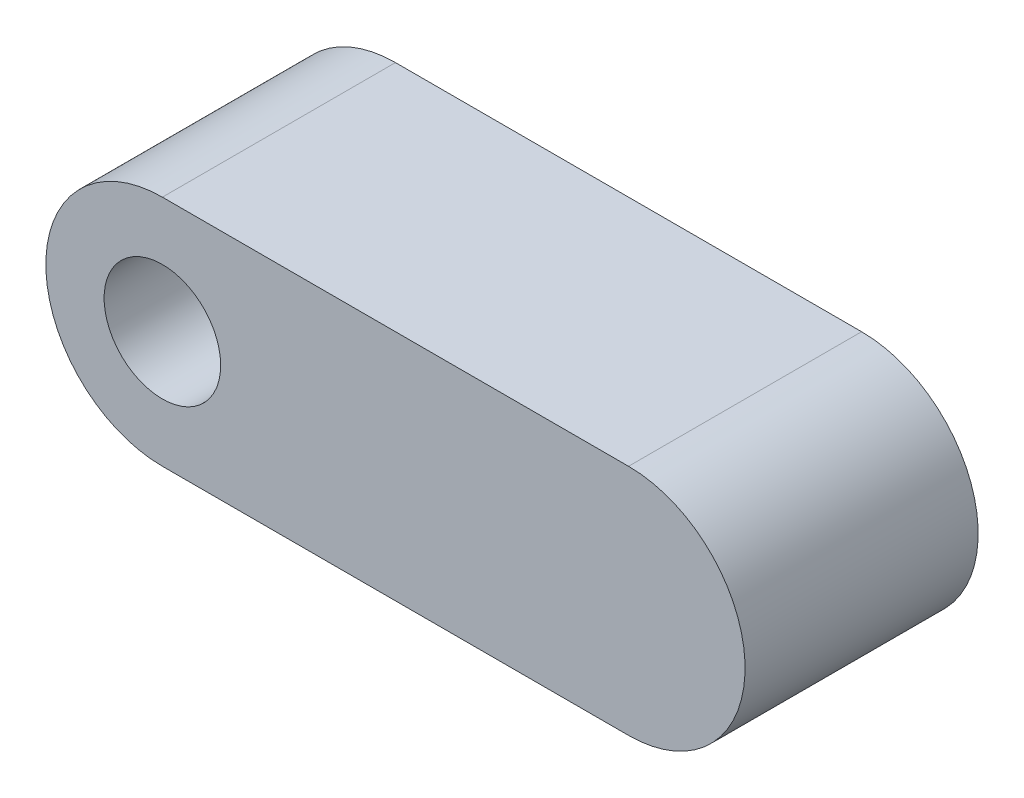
ISO-10303-21;
HEADER;
FILE_DESCRIPTION(('STEP AP214'),'2;1');
FILE_NAME('part.step','',(''),(''),'','','');
FILE_SCHEMA(('AUTOMOTIVE_DESIGN { 1 0 10303 214 1 1 1 1 }'));
ENDSEC;
DATA;
#1=APPLICATION_CONTEXT('core data for automotive mechanical design processes');
#2=APPLICATION_PROTOCOL_DEFINITION('international standard','automotive_design',2000,#1);
#3=PRODUCT_CONTEXT('',#1,'mechanical');
#4=PRODUCT('Part','Part','',(#3));
#5=PRODUCT_RELATED_PRODUCT_CATEGORY('part','',(#4));
#6=PRODUCT_DEFINITION_FORMATION('','',#4);
#7=PRODUCT_DEFINITION_CONTEXT('part definition',#1,'design');
#8=PRODUCT_DEFINITION('design','',#6,#7);
#9=PRODUCT_DEFINITION_SHAPE('','',#8);
#10=(LENGTH_UNIT() NAMED_UNIT(*) SI_UNIT(.MILLI.,.METRE.));
#11=(NAMED_UNIT(*) PLANE_ANGLE_UNIT() SI_UNIT($,.RADIAN.));
#12=(NAMED_UNIT(*) SI_UNIT($,.STERADIAN.) SOLID_ANGLE_UNIT());
#13=UNCERTAINTY_MEASURE_WITH_UNIT(LENGTH_MEASURE(1.E-05),#10,'distance_accuracy_value','');
#14=(GEOMETRIC_REPRESENTATION_CONTEXT(3) GLOBAL_UNCERTAINTY_ASSIGNED_CONTEXT((#13)) GLOBAL_UNIT_ASSIGNED_CONTEXT((#10,
#11,#12)) REPRESENTATION_CONTEXT('',''));
#15=CARTESIAN_POINT('',(0.,0.,0.));
#16=DIRECTION('',(0.,0.,1.));
#17=DIRECTION('',(1.,0.,0.));
#18=AXIS2_PLACEMENT_3D('',#15,#16,#17);
#19=CARTESIAN_POINT('',(0.,0.,0.999999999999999));
#20=DIRECTION('',(0.,0.,1.));
#21=DIRECTION('',(1.,0.,0.));
#22=AXIS2_PLACEMENT_3D('',#19,#20,#21);
#23=PLANE('',#22);
#24=CARTESIAN_POINT('',(0.,0.,0.999999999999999));
#25=DIRECTION('',(0.,0.,1.));
#26=DIRECTION('',(1.,0.,0.));
#27=AXIS2_PLACEMENT_3D('',#24,#25,#26);
#28=CIRCLE('',#27,1.);
#29=CARTESIAN_POINT('',(0.,1.,0.999999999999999));
#30=VERTEX_POINT('',#29);
#31=CARTESIAN_POINT('',(0.,-0.999999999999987,0.999999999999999));
#32=VERTEX_POINT('',#31);
#33=EDGE_CURVE('E104',#30,#32,#28,.T.);
#34=ORIENTED_EDGE('',*,*,#33,.T.);
#35=DIRECTION('',(1.,0.,0.));
#36=VECTOR('',#35,1.);
#37=CARTESIAN_POINT('',(0.,-0.999999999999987,0.999999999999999));
#38=LINE('',#37,#36);
#39=CARTESIAN_POINT('',(4.,-0.999999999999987,1.));
#40=VERTEX_POINT('',#39);
#41=EDGE_CURVE('E89',#32,#40,#38,.T.);
#42=ORIENTED_EDGE('',*,*,#41,.T.);
#43=CARTESIAN_POINT('',(4.,0.,1.));
#44=DIRECTION('',(0.,0.,1.));
#45=DIRECTION('',(-1.,0.,0.));
#46=AXIS2_PLACEMENT_3D('',#43,#44,#45);
#47=CIRCLE('',#46,1.);
#48=CARTESIAN_POINT('',(3.99999999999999,1.,1.));
#49=VERTEX_POINT('',#48);
#50=EDGE_CURVE('E55',#40,#49,#47,.T.);
#51=ORIENTED_EDGE('',*,*,#50,.T.);
#52=DIRECTION('',(-1.,0.,0.));
#53=VECTOR('',#52,1.);
#54=CARTESIAN_POINT('',(0.,1.,0.999999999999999));
#55=LINE('',#54,#53);
#56=EDGE_CURVE('E50',#49,#30,#55,.T.);
#57=ORIENTED_EDGE('',*,*,#56,.T.);
#58=EDGE_LOOP('',(#34,#42,#51,#57));
#59=FACE_BOUND('',#58,.T.);
#60=CARTESIAN_POINT('',(0.,0.,0.999999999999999));
#61=DIRECTION('',(0.,0.,1.));
#62=DIRECTION('',(1.,0.,0.));
#63=AXIS2_PLACEMENT_3D('',#60,#61,#62);
#64=CIRCLE('',#63,0.5);
#65=CARTESIAN_POINT('',(0.5,0.,0.999999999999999));
#66=VERTEX_POINT('',#65);
#67=EDGE_CURVE('E94',#66,#66,#64,.T.);
#68=ORIENTED_EDGE('',*,*,#67,.F.);
#69=EDGE_LOOP('',(#68));
#70=FACE_BOUND('',#69,.T.);
#71=ADVANCED_FACE('F35',(#59,#70),#23,.T.);
#72=CARTESIAN_POINT('',(0.,0.,-1.));
#73=DIRECTION('',(0.,0.,1.));
#74=DIRECTION('',(1.,0.,0.));
#75=AXIS2_PLACEMENT_3D('',#72,#73,#74);
#76=PLANE('',#75);
#77=CARTESIAN_POINT('',(0.,0.,-1.));
#78=DIRECTION('',(0.,0.,1.));
#79=DIRECTION('',(1.,0.,0.));
#80=AXIS2_PLACEMENT_3D('',#77,#78,#79);
#81=CIRCLE('',#80,1.);
#82=CARTESIAN_POINT('',(0.,1.,-1.));
#83=VERTEX_POINT('',#82);
#84=CARTESIAN_POINT('',(0.,-0.999999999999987,-1.));
#85=VERTEX_POINT('',#84);
#86=EDGE_CURVE('E81',#83,#85,#81,.T.);
#87=ORIENTED_EDGE('',*,*,#86,.F.);
#88=DIRECTION('',(-1.,0.,0.));
#89=VECTOR('',#88,1.);
#90=CARTESIAN_POINT('',(0.,1.,-1.));
#91=LINE('',#90,#89);
#92=CARTESIAN_POINT('',(3.99999999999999,1.,-1.));
#93=VERTEX_POINT('',#92);
#94=EDGE_CURVE('E102',#93,#83,#91,.T.);
#95=ORIENTED_EDGE('',*,*,#94,.F.);
#96=CARTESIAN_POINT('',(4.,0.,-1.));
#97=DIRECTION('',(0.,0.,1.));
#98=DIRECTION('',(-1.,0.,0.));
#99=AXIS2_PLACEMENT_3D('',#96,#97,#98);
#100=CIRCLE('',#99,1.);
#101=CARTESIAN_POINT('',(4.,-0.999999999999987,-1.));
#102=VERTEX_POINT('',#101);
#103=EDGE_CURVE('E82',#102,#93,#100,.T.);
#104=ORIENTED_EDGE('',*,*,#103,.F.);
#105=DIRECTION('',(1.,0.,0.));
#106=VECTOR('',#105,1.);
#107=CARTESIAN_POINT('',(0.,-0.999999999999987,-1.));
#108=LINE('',#107,#106);
#109=EDGE_CURVE('E76',#85,#102,#108,.T.);
#110=ORIENTED_EDGE('',*,*,#109,.F.);
#111=EDGE_LOOP('',(#87,#95,#104,#110));
#112=FACE_BOUND('',#111,.T.);
#113=CARTESIAN_POINT('',(0.,0.,-1.));
#114=DIRECTION('',(0.,0.,1.));
#115=DIRECTION('',(1.,0.,0.));
#116=AXIS2_PLACEMENT_3D('',#113,#114,#115);
#117=CIRCLE('',#116,0.5);
#118=CARTESIAN_POINT('',(0.5,0.,-1.));
#119=VERTEX_POINT('',#118);
#120=EDGE_CURVE('E97',#119,#119,#117,.T.);
#121=ORIENTED_EDGE('',*,*,#120,.T.);
#122=EDGE_LOOP('',(#121));
#123=FACE_BOUND('',#122,.T.);
#124=ADVANCED_FACE('F77',(#112,#123),#76,.F.);
#125=CARTESIAN_POINT('',(0.,0.,0.999999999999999));
#126=DIRECTION('',(0.,0.,-1.));
#127=DIRECTION('',(-1.,0.,0.));
#128=AXIS2_PLACEMENT_3D('',#125,#126,#127);
#129=CYLINDRICAL_SURFACE('',#128,1.);
#130=ORIENTED_EDGE('',*,*,#86,.T.);
#131=DIRECTION('',(0.,0.,-1.));
#132=VECTOR('',#131,1.);
#133=CARTESIAN_POINT('',(0.,-0.999999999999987,0.999999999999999));
#134=LINE('',#133,#132);
#135=EDGE_CURVE('E11',#32,#85,#134,.T.);
#136=ORIENTED_EDGE('',*,*,#135,.F.);
#137=ORIENTED_EDGE('',*,*,#33,.F.);
#138=DIRECTION('',(0.,0.,-1.));
#139=VECTOR('',#138,1.);
#140=CARTESIAN_POINT('',(0.,1.,0.999999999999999));
#141=LINE('',#140,#139);
#142=EDGE_CURVE('E93',#30,#83,#141,.T.);
#143=ORIENTED_EDGE('',*,*,#142,.T.);
#144=EDGE_LOOP('',(#130,#136,#137,#143));
#145=FACE_BOUND('',#144,.T.);
#146=ADVANCED_FACE('F37',(#145),#129,.T.);
#147=CARTESIAN_POINT('',(0.,-0.999999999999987,0.999999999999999));
#148=DIRECTION('',(0.,1.,0.));
#149=DIRECTION('',(0.,0.,1.));
#150=AXIS2_PLACEMENT_3D('',#147,#148,#149);
#151=PLANE('',#150);
#152=ORIENTED_EDGE('',*,*,#109,.T.);
#153=DIRECTION('',(0.,0.,-1.));
#154=VECTOR('',#153,1.);
#155=CARTESIAN_POINT('',(4.,-0.999999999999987,1.));
#156=LINE('',#155,#154);
#157=EDGE_CURVE('E43',#40,#102,#156,.T.);
#158=ORIENTED_EDGE('',*,*,#157,.F.);
#159=ORIENTED_EDGE('',*,*,#41,.F.);
#160=ORIENTED_EDGE('',*,*,#135,.T.);
#161=EDGE_LOOP('',(#152,#158,#159,#160));
#162=FACE_BOUND('',#161,.T.);
#163=ADVANCED_FACE('F88',(#162),#151,.F.);
#164=CARTESIAN_POINT('',(4.,0.,1.));
#165=DIRECTION('',(0.,0.,-1.));
#166=DIRECTION('',(-1.,0.,0.));
#167=AXIS2_PLACEMENT_3D('',#164,#165,#166);
#168=CYLINDRICAL_SURFACE('',#167,1.);
#169=ORIENTED_EDGE('',*,*,#103,.T.);
#170=DIRECTION('',(0.,0.,-1.));
#171=VECTOR('',#170,1.);
#172=CARTESIAN_POINT('',(3.99999999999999,1.,1.));
#173=LINE('',#172,#171);
#174=EDGE_CURVE('E110',#49,#93,#173,.T.);
#175=ORIENTED_EDGE('',*,*,#174,.F.);
#176=ORIENTED_EDGE('',*,*,#50,.F.);
#177=ORIENTED_EDGE('',*,*,#157,.T.);
#178=EDGE_LOOP('',(#169,#175,#176,#177));
#179=FACE_BOUND('',#178,.T.);
#180=ADVANCED_FACE('F113',(#179),#168,.T.);
#181=CARTESIAN_POINT('',(0.,1.,0.999999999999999));
#182=DIRECTION('',(0.,-1.,0.));
#183=DIRECTION('',(0.,0.,-1.));
#184=AXIS2_PLACEMENT_3D('',#181,#182,#183);
#185=PLANE('',#184);
#186=ORIENTED_EDGE('',*,*,#94,.T.);
#187=ORIENTED_EDGE('',*,*,#142,.F.);
#188=ORIENTED_EDGE('',*,*,#56,.F.);
#189=ORIENTED_EDGE('',*,*,#174,.T.);
#190=EDGE_LOOP('',(#186,#187,#188,#189));
#191=FACE_BOUND('',#190,.T.);
#192=ADVANCED_FACE('F115',(#191),#185,.F.);
#193=CARTESIAN_POINT('',(0.,0.,0.999999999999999));
#194=DIRECTION('',(0.,0.,-1.));
#195=DIRECTION('',(-1.,0.,0.));
#196=AXIS2_PLACEMENT_3D('',#193,#194,#195);
#197=CYLINDRICAL_SURFACE('',#196,0.5);
#198=ORIENTED_EDGE('',*,*,#67,.T.);
#199=EDGE_LOOP('',(#198));
#200=FACE_BOUND('',#199,.T.);
#201=ORIENTED_EDGE('',*,*,#120,.F.);
#202=EDGE_LOOP('',(#201));
#203=FACE_BOUND('',#202,.T.);
#204=ADVANCED_FACE('F121',(#200,#203),#197,.F.);
#205=CLOSED_SHELL('',(#71,#124,#146,#163,#180,#192,#204));
#206=MANIFOLD_SOLID_BREP('B2',#205);
#207=ADVANCED_BREP_SHAPE_REPRESENTATION('',(#18,#206),#14);
#208=SHAPE_DEFINITION_REPRESENTATION(#9,#207);
ENDSEC;
END-ISO-10303-21;
